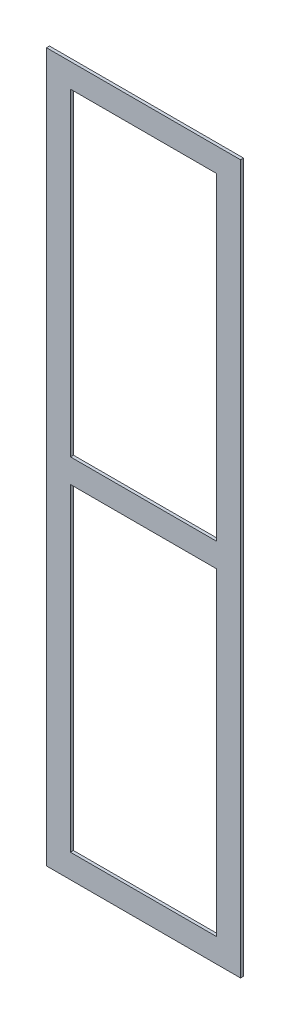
from build123d import *

# Parameters (mm, degrees)
SKETCH1_W                      = 103.175
SKETCH1_H                      = 103.175
SKETCH1_W_2                    = 100
SKETCH1_H_2                    = 100
BULKSHELLEXTRUDE_DEPTH         = 376.8
SKETCH14_W                     = 77.775
SKETCH14_H                     = 351.4
SIDEWALLCUT_DEPTH              = 103.1875
SIDEWALLCUTPATTERN_COUNT       = 4
SKETCH20_W                     = 77.775
SKETCH20_H                     = 12.7
CENTERSUPPORT_DEPTH            = 1.5875
CENTERSUPPORTPATTERNCIRC_COUNT = 4
SKETCH22_W                     = 100
SKETCH22_H                     = 376.8
CUT_EXTRUDE4_DEPTH             = 103.1875


with BuildPart() as part:
    # Sketch1 → BulkShellExtrude (new body)
    with BuildSketch(Plane(origin=(0, 0, 0), x_dir=(1, 0, 0), z_dir=(0, 1, 0))):
        Rectangle(SKETCH1_W, SKETCH1_H)
        Rectangle(SKETCH1_W_2, SKETCH1_H_2, mode=Mode.SUBTRACT)
    extrude(amount=BULKSHELLEXTRUDE_DEPTH)

    # Sketch14 → SideWallCut (cut)
    with BuildSketch(Plane(origin=(51.5875, 0, 0), x_dir=(0, 0, -1), z_dir=(1, 0, 0))):
        with Locations((0, 188.4)):
            Rectangle(SKETCH14_W, SKETCH14_H)
    sidewallcut = extrude(amount=-SIDEWALLCUT_DEPTH, mode=Mode.SUBTRACT)

    # SideWallCutPattern: SideWallCut ×4 about axis
    sidewallcutpattern_axis = Axis((0, 0, 0), (0, 1, 0))
    for i in range(1, SIDEWALLCUTPATTERN_COUNT):
        add(sidewallcut.rotate(sidewallcutpattern_axis, i * 360 / SIDEWALLCUTPATTERN_COUNT), mode=Mode.SUBTRACT)

    # Sketch20 → CenterSupport (add)
    with BuildSketch(Plane.XY.offset(51.5875)):
        with Locations((0, 188.4)):
            Rectangle(SKETCH20_W, SKETCH20_H)
    centersupport = extrude(amount=-CENTERSUPPORT_DEPTH)

    # CenterSupportPatternCirc: CenterSupport ×4 about axis
    centersupportpatterncirc_axis = Axis((0, 0, 0), (0, 1, 0))
    for i in range(1, CENTERSUPPORTPATTERNCIRC_COUNT):
        add(centersupport.rotate(centersupportpatterncirc_axis, i * 360 / CENTERSUPPORTPATTERNCIRC_COUNT))

    # Sketch22 → Cut-Extrude4 (cut)
    with BuildSketch(Plane(origin=(51.5875, 0, 0), x_dir=(0, 0, -1), z_dir=(1, 0, 0))):
        with Locations((0, 188.4)):
            Rectangle(SKETCH22_W, SKETCH22_H)
    extrude(amount=-CUT_EXTRUDE4_DEPTH, mode=Mode.SUBTRACT)


with BuildPart() as body_2:
    # of the pieces the cut leaves, the one that is kept (cut_extrude4_keep)
    add(part.part.solids().sort_by_distance((51.5875, 0, 51.5875))[0])


solid = body_2.part
